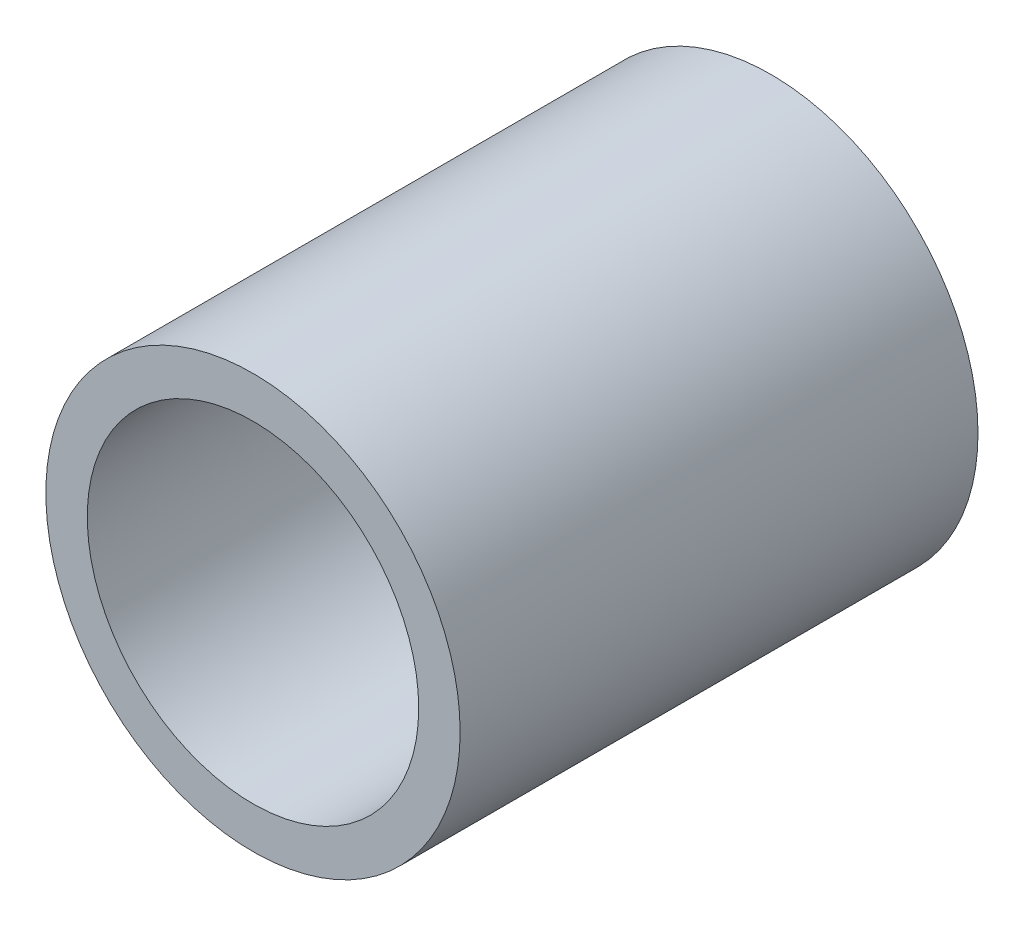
ISO-10303-21;
HEADER;
FILE_DESCRIPTION(('STEP AP214'),'2;1');
FILE_NAME('part.step','',(''),(''),'','','');
FILE_SCHEMA(('AUTOMOTIVE_DESIGN { 1 0 10303 214 1 1 1 1 }'));
ENDSEC;
DATA;
#1=APPLICATION_CONTEXT('core data for automotive mechanical design processes');
#2=APPLICATION_PROTOCOL_DEFINITION('international standard','automotive_design',2000,#1);
#3=PRODUCT_CONTEXT('',#1,'mechanical');
#4=PRODUCT('Part','Part','',(#3));
#5=PRODUCT_RELATED_PRODUCT_CATEGORY('part','',(#4));
#6=PRODUCT_DEFINITION_FORMATION('','',#4);
#7=PRODUCT_DEFINITION_CONTEXT('part definition',#1,'design');
#8=PRODUCT_DEFINITION('design','',#6,#7);
#9=PRODUCT_DEFINITION_SHAPE('','',#8);
#10=(LENGTH_UNIT() NAMED_UNIT(*) SI_UNIT(.MILLI.,.METRE.));
#11=(NAMED_UNIT(*) PLANE_ANGLE_UNIT() SI_UNIT($,.RADIAN.));
#12=(NAMED_UNIT(*) SI_UNIT($,.STERADIAN.) SOLID_ANGLE_UNIT());
#13=UNCERTAINTY_MEASURE_WITH_UNIT(LENGTH_MEASURE(1.E-05),#10,'distance_accuracy_value','');
#14=(GEOMETRIC_REPRESENTATION_CONTEXT(3) GLOBAL_UNCERTAINTY_ASSIGNED_CONTEXT((#13)) GLOBAL_UNIT_ASSIGNED_CONTEXT((#10,
#11,#12)) REPRESENTATION_CONTEXT('',''));
#15=CARTESIAN_POINT('',(0.,0.,0.));
#16=DIRECTION('',(0.,0.,1.));
#17=DIRECTION('',(1.,0.,0.));
#18=AXIS2_PLACEMENT_3D('',#15,#16,#17);
#19=CARTESIAN_POINT('',(0.,0.,12.5));
#20=DIRECTION('',(0.,0.,1.));
#21=DIRECTION('',(1.,0.,0.));
#22=AXIS2_PLACEMENT_3D('',#19,#20,#21);
#23=PLANE('',#22);
#24=CARTESIAN_POINT('',(0.,0.,12.5));
#25=DIRECTION('',(0.,0.,1.));
#26=DIRECTION('',(1.,0.,0.));
#27=AXIS2_PLACEMENT_3D('',#24,#25,#26);
#28=CIRCLE('',#27,5.);
#29=CARTESIAN_POINT('',(5.,0.,12.5));
#30=VERTEX_POINT('',#29);
#31=EDGE_CURVE('E10',#30,#30,#28,.T.);
#32=ORIENTED_EDGE('',*,*,#31,.T.);
#33=EDGE_LOOP('',(#32));
#34=FACE_BOUND('',#33,.T.);
#35=CARTESIAN_POINT('',(0.,0.,12.5));
#36=DIRECTION('',(0.,0.,1.));
#37=DIRECTION('',(1.,0.,0.));
#38=AXIS2_PLACEMENT_3D('',#35,#36,#37);
#39=CIRCLE('',#38,4.);
#40=CARTESIAN_POINT('',(4.,0.,12.5));
#41=VERTEX_POINT('',#40);
#42=EDGE_CURVE('E42',#41,#41,#39,.T.);
#43=ORIENTED_EDGE('',*,*,#42,.F.);
#44=EDGE_LOOP('',(#43));
#45=FACE_BOUND('',#44,.T.);
#46=ADVANCED_FACE('F31',(#34,#45),#23,.T.);
#47=CARTESIAN_POINT('',(0.,0.,0.));
#48=DIRECTION('',(0.,0.,1.));
#49=DIRECTION('',(1.,0.,0.));
#50=AXIS2_PLACEMENT_3D('',#47,#48,#49);
#51=PLANE('',#50);
#52=CARTESIAN_POINT('',(0.,0.,0.));
#53=DIRECTION('',(0.,0.,1.));
#54=DIRECTION('',(1.,0.,0.));
#55=AXIS2_PLACEMENT_3D('',#52,#53,#54);
#56=CIRCLE('',#55,5.);
#57=CARTESIAN_POINT('',(5.,0.,0.));
#58=VERTEX_POINT('',#57);
#59=EDGE_CURVE('E35',#58,#58,#56,.T.);
#60=ORIENTED_EDGE('',*,*,#59,.F.);
#61=EDGE_LOOP('',(#60));
#62=FACE_BOUND('',#61,.T.);
#63=CARTESIAN_POINT('',(0.,0.,0.));
#64=DIRECTION('',(0.,0.,1.));
#65=DIRECTION('',(1.,0.,0.));
#66=AXIS2_PLACEMENT_3D('',#63,#64,#65);
#67=CIRCLE('',#66,4.);
#68=CARTESIAN_POINT('',(4.,0.,0.));
#69=VERTEX_POINT('',#68);
#70=EDGE_CURVE('E44',#69,#69,#67,.T.);
#71=ORIENTED_EDGE('',*,*,#70,.T.);
#72=EDGE_LOOP('',(#71));
#73=FACE_BOUND('',#72,.T.);
#74=ADVANCED_FACE('F54',(#62,#73),#51,.F.);
#75=CARTESIAN_POINT('',(0.,0.,12.5));
#76=DIRECTION('',(0.,0.,-1.));
#77=DIRECTION('',(-1.,0.,0.));
#78=AXIS2_PLACEMENT_3D('',#75,#76,#77);
#79=CYLINDRICAL_SURFACE('',#78,5.);
#80=ORIENTED_EDGE('',*,*,#31,.F.);
#81=EDGE_LOOP('',(#80));
#82=FACE_BOUND('',#81,.T.);
#83=ORIENTED_EDGE('',*,*,#59,.T.);
#84=EDGE_LOOP('',(#83));
#85=FACE_BOUND('',#84,.T.);
#86=ADVANCED_FACE('F33',(#82,#85),#79,.T.);
#87=CARTESIAN_POINT('',(0.,0.,12.5));
#88=DIRECTION('',(0.,0.,-1.));
#89=DIRECTION('',(-1.,0.,0.));
#90=AXIS2_PLACEMENT_3D('',#87,#88,#89);
#91=CYLINDRICAL_SURFACE('',#90,4.);
#92=ORIENTED_EDGE('',*,*,#42,.T.);
#93=EDGE_LOOP('',(#92));
#94=FACE_BOUND('',#93,.T.);
#95=ORIENTED_EDGE('',*,*,#70,.F.);
#96=EDGE_LOOP('',(#95));
#97=FACE_BOUND('',#96,.T.);
#98=ADVANCED_FACE('F50',(#94,#97),#91,.F.);
#99=CLOSED_SHELL('',(#46,#74,#86,#98));
#100=MANIFOLD_SOLID_BREP('B2',#99);
#101=ADVANCED_BREP_SHAPE_REPRESENTATION('',(#18,#100),#14);
#102=SHAPE_DEFINITION_REPRESENTATION(#9,#101);
ENDSEC;
END-ISO-10303-21;
